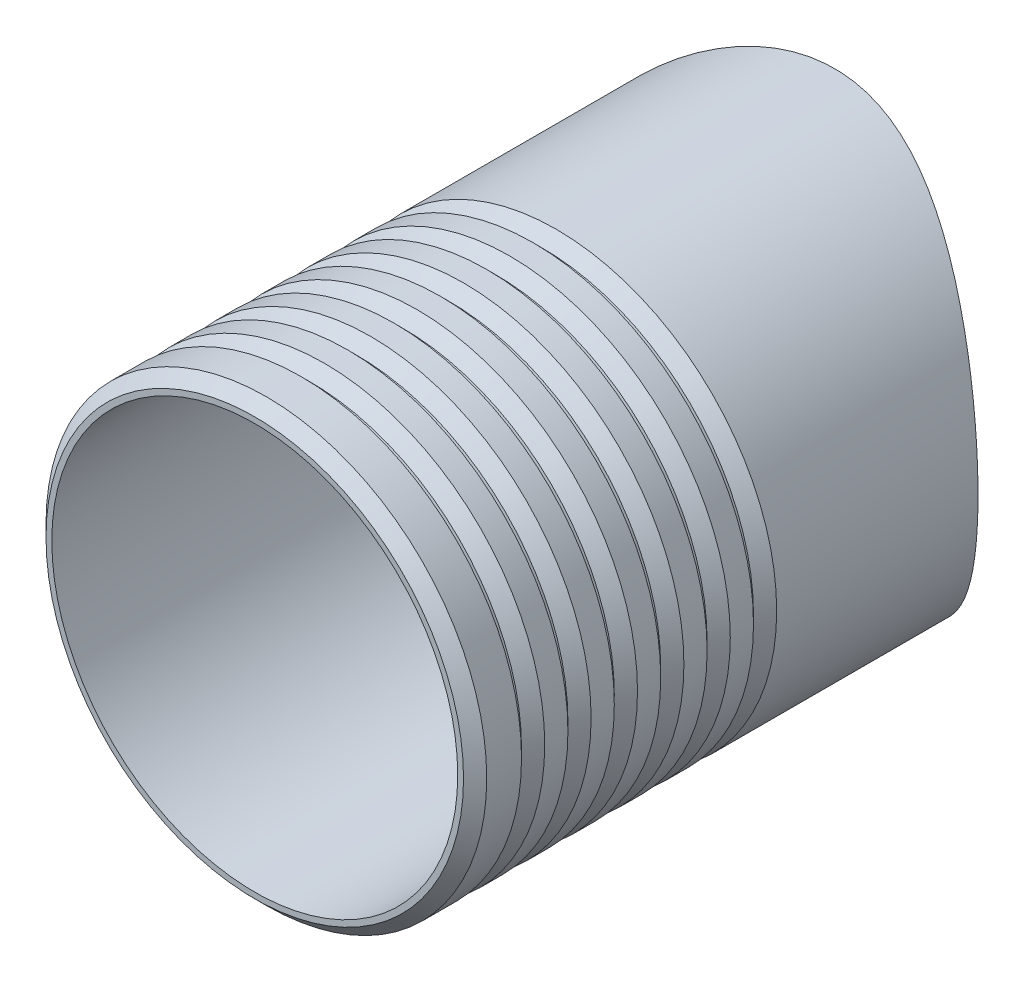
ISO-10303-21;
HEADER;
FILE_DESCRIPTION(('STEP AP214'),'2;1');
FILE_NAME('part.step','',(''),(''),'','','');
FILE_SCHEMA(('AUTOMOTIVE_DESIGN { 1 0 10303 214 1 1 1 1 }'));
ENDSEC;
DATA;
#1=APPLICATION_CONTEXT('core data for automotive mechanical design processes');
#2=APPLICATION_PROTOCOL_DEFINITION('international standard','automotive_design',2000,#1);
#3=PRODUCT_CONTEXT('',#1,'mechanical');
#4=PRODUCT('Part','Part','',(#3));
#5=PRODUCT_RELATED_PRODUCT_CATEGORY('part','',(#4));
#6=PRODUCT_DEFINITION_FORMATION('','',#4);
#7=PRODUCT_DEFINITION_CONTEXT('part definition',#1,'design');
#8=PRODUCT_DEFINITION('design','',#6,#7);
#9=PRODUCT_DEFINITION_SHAPE('','',#8);
#10=(LENGTH_UNIT() NAMED_UNIT(*) SI_UNIT(.MILLI.,.METRE.));
#11=(NAMED_UNIT(*) PLANE_ANGLE_UNIT() SI_UNIT($,.RADIAN.));
#12=(NAMED_UNIT(*) SI_UNIT($,.STERADIAN.) SOLID_ANGLE_UNIT());
#13=UNCERTAINTY_MEASURE_WITH_UNIT(LENGTH_MEASURE(1.E-05),#10,'distance_accuracy_value','');
#14=(GEOMETRIC_REPRESENTATION_CONTEXT(3) GLOBAL_UNCERTAINTY_ASSIGNED_CONTEXT((#13)) GLOBAL_UNIT_ASSIGNED_CONTEXT((#10,
#11,#12)) REPRESENTATION_CONTEXT('',''));
#15=CARTESIAN_POINT('',(0.,0.,0.));
#16=DIRECTION('',(0.,0.,1.));
#17=DIRECTION('',(1.,0.,0.));
#18=AXIS2_PLACEMENT_3D('',#15,#16,#17);
#19=CARTESIAN_POINT('',(0.,0.,100.));
#20=DIRECTION('',(0.,0.,-1.));
#21=DIRECTION('',(-1.,0.,0.));
#22=AXIS2_PLACEMENT_3D('',#19,#20,#21);
#23=CYLINDRICAL_SURFACE('',#22,38.);
#24=CARTESIAN_POINT('',(0.,0.,56.));
#25=DIRECTION('',(0.,0.,1.));
#26=DIRECTION('',(1.,0.,0.));
#27=AXIS2_PLACEMENT_3D('',#24,#25,#26);
#28=CIRCLE('',#27,38.);
#29=CARTESIAN_POINT('',(38.,0.,56.));
#30=VERTEX_POINT('',#29);
#31=EDGE_CURVE('E94',#30,#30,#28,.T.);
#32=ORIENTED_EDGE('',*,*,#31,.F.);
#33=EDGE_LOOP('',(#32));
#34=FACE_BOUND('',#33,.T.);
#35=CARTESIAN_POINT('',(0.,0.,52.));
#36=DIRECTION('',(0.,0.,1.));
#37=DIRECTION('',(1.,0.,0.));
#38=AXIS2_PLACEMENT_3D('',#35,#36,#37);
#39=CIRCLE('',#38,38.);
#40=CARTESIAN_POINT('',(38.,0.,52.));
#41=VERTEX_POINT('',#40);
#42=EDGE_CURVE('E97',#41,#41,#39,.T.);
#43=ORIENTED_EDGE('',*,*,#42,.T.);
#44=EDGE_LOOP('',(#43));
#45=FACE_BOUND('',#44,.T.);
#46=ADVANCED_FACE('F30',(#34,#45),#23,.T.);
#47=CARTESIAN_POINT('',(-38.,0.,13.2820788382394));
#48=CARTESIAN_POINT('',(-37.9999991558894,-0.966377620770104,13.2820774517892));
#49=CARTESIAN_POINT('',(-37.9630888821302,-1.93277648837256,13.2590643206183));
#50=CARTESIAN_POINT('',(-37.8159615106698,-3.85820976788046,13.1675751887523));
#51=CARTESIAN_POINT('',(-37.7057116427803,-4.81724069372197,13.0990788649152));
#52=CARTESIAN_POINT('',(-37.4132111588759,-6.72171246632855,12.9181667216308));
#53=CARTESIAN_POINT('',(-37.2308374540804,-7.66712720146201,12.8056758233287));
#54=CARTESIAN_POINT('',(-36.7965908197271,-9.53577555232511,12.5395239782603));
#55=CARTESIAN_POINT('',(-36.5447248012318,-10.4590113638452,12.3858671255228));
#56=CARTESIAN_POINT('',(-35.9760284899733,-12.2729125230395,12.0417948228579));
#57=CARTESIAN_POINT('',(-35.6595286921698,-13.1637174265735,11.8515666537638));
#58=CARTESIAN_POINT('',(-34.9642393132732,-14.9126675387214,11.4379741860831));
#59=CARTESIAN_POINT('',(-34.5854484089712,-15.7708120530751,11.2146091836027));
#60=CARTESIAN_POINT('',(-33.7692603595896,-17.4501721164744,10.7393530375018));
#61=CARTESIAN_POINT('',(-33.3318787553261,-18.271397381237,10.4874694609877));
#62=CARTESIAN_POINT('',(-32.4019193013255,-19.8739534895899,9.95995796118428));
#63=CARTESIAN_POINT('',(-31.9093391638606,-20.6552826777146,9.68432905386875));
#64=CARTESIAN_POINT('',(-30.8309754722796,-22.235955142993,9.09167511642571));
#65=CARTESIAN_POINT('',(-30.2408945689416,-23.0317858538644,8.77310128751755));
#66=CARTESIAN_POINT('',(-29.0039155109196,-24.5712863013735,8.12069415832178));
#67=CARTESIAN_POINT('',(-28.3570148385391,-25.3149537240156,7.7868601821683));
#68=CARTESIAN_POINT('',(-27.0087665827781,-26.7487596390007,7.11029234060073));
#69=CARTESIAN_POINT('',(-26.3073516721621,-27.4388297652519,6.76754782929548));
#70=CARTESIAN_POINT('',(-24.8535350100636,-28.7622705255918,6.08066373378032));
#71=CARTESIAN_POINT('',(-24.1011303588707,-29.3956379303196,5.73652407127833));
#72=CARTESIAN_POINT('',(-22.4431739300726,-30.6846854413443,5.00843882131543));
#73=CARTESIAN_POINT('',(-21.5306357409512,-31.3319067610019,4.62536564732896));
#74=CARTESIAN_POINT('',(-19.6460920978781,-32.546705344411,3.87878873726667));
#75=CARTESIAN_POINT('',(-18.6740756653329,-33.1142678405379,3.51528863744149));
#76=CARTESIAN_POINT('',(-16.6756085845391,-34.1642564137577,2.82116475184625));
#77=CARTESIAN_POINT('',(-15.6492336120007,-34.6467970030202,2.49049701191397));
#78=CARTESIAN_POINT('',(-13.5457184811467,-35.5219622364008,1.87518984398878));
#79=CARTESIAN_POINT('',(-12.4685993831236,-35.9146237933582,1.59053153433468));
#80=CARTESIAN_POINT('',(-10.5539894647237,-36.5149862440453,1.14675807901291));
#81=CARTESIAN_POINT('',(-9.72633014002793,-36.7442721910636,0.974197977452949));
#82=CARTESIAN_POINT('',(-8.05065201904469,-37.1473978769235,0.667357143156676));
#83=CARTESIAN_POINT('',(-7.20263648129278,-37.3212464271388,0.533070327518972));
#84=CARTESIAN_POINT('',(-5.49212135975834,-37.6110104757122,0.307547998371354));
#85=CARTESIAN_POINT('',(-4.62964036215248,-37.7269951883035,0.216261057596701));
#86=CARTESIAN_POINT('',(-2.89506362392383,-37.8995797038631,0.0799245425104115));
#87=CARTESIAN_POINT('',(-2.02296774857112,-37.9561786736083,0.0348756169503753));
#88=CARTESIAN_POINT('',(-0.273518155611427,-38.009117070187,-0.00724931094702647));
#89=CARTESIAN_POINT('',(0.603843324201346,-38.0053004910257,-0.00420111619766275));
#90=CARTESIAN_POINT('',(2.35469515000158,-37.9370924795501,0.0500478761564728));
#91=CARTESIAN_POINT('',(3.22818547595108,-37.8727007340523,0.101248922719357));
#92=CARTESIAN_POINT('',(4.96530529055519,-37.6843420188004,0.249824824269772));
#93=CARTESIAN_POINT('',(5.82892757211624,-37.5603340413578,0.347231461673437));
#94=CARTESIAN_POINT('',(7.53989452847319,-37.2546016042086,0.584583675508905));
#95=CARTESIAN_POINT('',(8.38723884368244,-37.0728758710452,0.724530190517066));
#96=CARTESIAN_POINT('',(10.0422903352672,-36.658751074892,1.03863585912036));
#97=CARTESIAN_POINT('',(10.8504597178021,-36.4275627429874,1.21196912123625));
#98=CARTESIAN_POINT('',(12.4431047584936,-35.9147475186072,1.58960579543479));
#99=CARTESIAN_POINT('',(13.2275810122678,-35.6331218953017,1.79390842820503));
#100=CARTESIAN_POINT('',(14.7703419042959,-35.0217881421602,2.22819859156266));
#101=CARTESIAN_POINT('',(15.5286218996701,-34.6920715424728,2.45819064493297));
#102=CARTESIAN_POINT('',(17.0169156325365,-33.9868042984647,2.93856103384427));
#103=CARTESIAN_POINT('',(17.7469256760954,-33.6112476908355,3.18894202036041));
#104=CARTESIAN_POINT('',(19.3100147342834,-32.7423979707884,3.75295455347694));
#105=CARTESIAN_POINT('',(20.1370310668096,-32.2401957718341,4.06969240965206));
#106=CARTESIAN_POINT('',(21.7468299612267,-31.1770115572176,4.71662133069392));
#107=CARTESIAN_POINT('',(22.5296085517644,-30.6160242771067,5.04681359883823));
#108=CARTESIAN_POINT('',(24.0495303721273,-29.4371506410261,5.71346539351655));
#109=CARTESIAN_POINT('',(24.7866311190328,-28.8192126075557,6.04993038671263));
#110=CARTESIAN_POINT('',(26.2121899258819,-27.5289927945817,6.72180441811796));
#111=CARTESIAN_POINT('',(26.9006448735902,-26.8567075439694,7.05721338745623));
#112=CARTESIAN_POINT('',(28.3344602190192,-25.3458571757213,7.77438296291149));
#113=CARTESIAN_POINT('',(29.0708045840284,-24.4980504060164,8.15478738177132));
#114=CARTESIAN_POINT('',(30.4695054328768,-22.7348987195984,8.8951405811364));
#115=CARTESIAN_POINT('',(31.1318531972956,-21.8195458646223,9.25508694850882));
#116=CARTESIAN_POINT('',(32.3767695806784,-19.9255716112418,9.94477706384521));
#117=CARTESIAN_POINT('',(32.959357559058,-18.9469656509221,10.2745281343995));
#118=CARTESIAN_POINT('',(34.0385992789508,-16.9316321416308,10.8946303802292));
#119=CARTESIAN_POINT('',(34.5352632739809,-15.8949115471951,11.1849862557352));
#120=CARTESIAN_POINT('',(35.4114475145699,-13.828172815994,11.703057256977));
#121=CARTESIAN_POINT('',(35.7958982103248,-12.8009049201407,11.9333343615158));
#122=CARTESIAN_POINT('',(36.3064341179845,-11.2314742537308,12.2415565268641));
#123=CARTESIAN_POINT('',(36.4656113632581,-10.7034814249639,12.3381119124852));
#124=CARTESIAN_POINT('',(36.7613164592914,-9.63901207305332,12.5181193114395));
#125=CARTESIAN_POINT('',(36.8978473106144,-9.10253668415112,12.6015730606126));
#126=CARTESIAN_POINT('',(37.147559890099,-8.02281507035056,12.7546469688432));
#127=CARTESIAN_POINT('',(37.2607650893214,-7.47957624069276,12.8242810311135));
#128=CARTESIAN_POINT('',(37.463489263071,-6.38713971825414,12.9492582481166));
#129=CARTESIAN_POINT('',(37.5530114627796,-5.83794284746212,13.0046033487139));
#130=CARTESIAN_POINT('',(37.7079669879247,-4.73490552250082,13.1005551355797));
#131=CARTESIAN_POINT('',(37.7734019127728,-4.18106537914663,13.1411628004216));
#132=CARTESIAN_POINT('',(37.8798795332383,-3.07021081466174,13.2073082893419));
#133=CARTESIAN_POINT('',(37.920923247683,-2.51319652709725,13.232846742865));
#134=CARTESIAN_POINT('',(37.9986533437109,-1.00421576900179,13.2812251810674));
#135=CARTESIAN_POINT('',(38.0119050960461,-0.0504257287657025,13.2894925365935));
#136=CARTESIAN_POINT('',(37.9666782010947,1.85455434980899,13.2613247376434));
#137=CARTESIAN_POINT('',(37.9082080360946,2.80574468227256,13.2248948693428));
#138=CARTESIAN_POINT('',(37.7204158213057,4.69833777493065,13.1082602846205));
#139=CARTESIAN_POINT('',(37.591098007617,5.63974111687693,13.0280581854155));
#140=CARTESIAN_POINT('',(37.2633837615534,7.5058497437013,12.8258082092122));
#141=CARTESIAN_POINT('',(37.0649860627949,8.43055472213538,12.703759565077));
#142=CARTESIAN_POINT('',(36.6104690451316,10.2222890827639,12.4260343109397));
#143=CARTESIAN_POINT('',(36.3568261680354,11.090175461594,12.2718097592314));
#144=CARTESIAN_POINT('',(35.7907247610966,12.7997993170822,11.9304233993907));
#145=CARTESIAN_POINT('',(35.4782686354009,13.641537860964,11.7432629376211));
#146=CARTESIAN_POINT('',(34.7975116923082,15.2948527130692,11.3396076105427));
#147=CARTESIAN_POINT('',(34.4292075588,16.1064272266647,11.1231110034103));
#148=CARTESIAN_POINT('',(33.6398288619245,17.6960324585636,10.6647376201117));
#149=CARTESIAN_POINT('',(33.2187509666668,18.4740610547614,10.4228592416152));
#150=CARTESIAN_POINT('',(32.2816491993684,20.0707898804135,9.89232876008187));
#151=CARTESIAN_POINT('',(31.7603288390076,20.8856331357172,9.60142042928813));
#152=CARTESIAN_POINT('',(30.6610587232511,22.4683790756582,8.99970329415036));
#153=CARTESIAN_POINT('',(30.0831058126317,23.2362791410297,8.68889338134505));
#154=CARTESIAN_POINT('',(28.8733143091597,24.7235011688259,8.05306723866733));
#155=CARTESIAN_POINT('',(28.2414222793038,25.4427736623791,7.72803707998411));
#156=CARTESIAN_POINT('',(26.9271670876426,26.829845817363,7.07029521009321));
#157=CARTESIAN_POINT('',(26.2448013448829,27.4976428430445,6.73758310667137));
#158=CARTESIAN_POINT('',(24.7302356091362,28.8722473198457,6.02290663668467));
#159=CARTESIAN_POINT('',(23.8906148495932,29.5708057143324,5.64075487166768));
#160=CARTESIAN_POINT('',(22.1517168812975,30.8949175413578,4.88517096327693));
#161=CARTESIAN_POINT('',(21.2524296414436,31.5204586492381,4.51174030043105));
#162=CARTESIAN_POINT('',(19.397841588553,32.6944574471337,3.78498001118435));
#163=CARTESIAN_POINT('',(18.4425709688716,33.2429561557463,3.43163974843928));
#164=CARTESIAN_POINT('',(16.4790963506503,34.2587264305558,2.75693845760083));
#165=CARTESIAN_POINT('',(15.4709074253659,34.7260209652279,2.43556839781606));
#166=CARTESIAN_POINT('',(13.6235017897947,35.4848792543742,1.90053597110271));
#167=CARTESIAN_POINT('',(12.7933918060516,35.7927282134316,1.67844136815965));
#168=CARTESIAN_POINT('',(11.1060102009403,36.3517004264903,1.26854720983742));
#169=CARTESIAN_POINT('',(10.248741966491,36.602830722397,1.08074339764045));
#170=CARTESIAN_POINT('',(8.51225424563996,37.0451497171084,0.745816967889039));
#171=CARTESIAN_POINT('',(7.63306529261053,37.2364172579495,0.598640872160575));
#172=CARTESIAN_POINT('',(5.8569622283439,37.5567586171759,0.350063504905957));
#173=CARTESIAN_POINT('',(4.96004815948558,37.6858325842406,0.248662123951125));
#174=CARTESIAN_POINT('',(3.14993242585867,37.8802195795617,0.0953042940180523));
#175=CARTESIAN_POINT('',(2.23666749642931,37.9451695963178,0.0436293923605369));
#176=CARTESIAN_POINT('',(0.406353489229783,38.0088588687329,-0.00703820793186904));
#177=CARTESIAN_POINT('',(-0.510695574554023,38.0075983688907,-0.00603110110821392));
#178=CARTESIAN_POINT('',(-2.3410015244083,37.9388816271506,0.0486270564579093));
#179=CARTESIAN_POINT('',(-3.25425708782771,37.8714039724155,0.102295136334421));
#180=CARTESIAN_POINT('',(-5.06916425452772,37.6714359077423,0.259980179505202));
#181=CARTESIAN_POINT('',(-5.97081600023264,37.538946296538,0.363996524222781));
#182=CARTESIAN_POINT('',(-7.68633422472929,37.2239268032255,0.608216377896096));
#183=CARTESIAN_POINT('',(-8.50156837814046,37.0460979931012,0.74497048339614));
#184=CARTESIAN_POINT('',(-10.1123061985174,36.6392036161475,1.0533186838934));
#185=CARTESIAN_POINT('',(-10.9078111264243,36.4101413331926,1.22491054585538));
#186=CARTESIAN_POINT('',(-12.4759639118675,35.9030598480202,1.59809372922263));
#187=CARTESIAN_POINT('',(-13.2486062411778,35.6250289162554,1.79969223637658));
#188=CARTESIAN_POINT('',(-14.7684729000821,35.0222872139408,2.22780905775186));
#189=CARTESIAN_POINT('',(-15.5156937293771,34.6975700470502,2.45433078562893));
#190=CARTESIAN_POINT('',(-16.6693329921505,34.1518596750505,2.82620168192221));
#191=CARTESIAN_POINT('',(-17.0850438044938,33.9457759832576,2.96491374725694));
#192=CARTESIAN_POINT('',(-17.9070690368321,33.5194153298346,3.24789350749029));
#193=CARTESIAN_POINT('',(-18.3133853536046,33.2991412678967,3.39216006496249));
#194=CARTESIAN_POINT('',(-19.5180680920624,32.617427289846,3.83201401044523));
#195=CARTESIAN_POINT('',(-20.3021699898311,32.1350947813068,4.13465622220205));
#196=CARTESIAN_POINT('',(-21.8306110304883,31.1170100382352,4.75194024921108));
#197=CARTESIAN_POINT('',(-22.5749228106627,30.5812217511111,5.06659007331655));
#198=CARTESIAN_POINT('',(-24.021546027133,29.4585075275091,5.70129121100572));
#199=CARTESIAN_POINT('',(-24.7238544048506,28.8715778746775,6.02134291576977));
#200=CARTESIAN_POINT('',(-26.2175964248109,27.5287817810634,6.72330075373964));
#201=CARTESIAN_POINT('',(-26.9996108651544,26.7623210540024,7.10506670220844));
#202=CARTESIAN_POINT('',(-28.4970728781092,25.1618360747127,7.85783148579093));
#203=CARTESIAN_POINT('',(-29.2125118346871,24.3278031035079,8.2288289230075));
#204=CARTESIAN_POINT('',(-30.5727165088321,22.5947551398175,8.95092948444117));
#205=CARTESIAN_POINT('',(-31.2174333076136,21.6956958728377,9.30201875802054));
#206=CARTESIAN_POINT('',(-32.4302733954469,19.8370554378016,9.97495672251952));
#207=CARTESIAN_POINT('',(-32.9984032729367,18.8774794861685,10.2968079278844));
#208=CARTESIAN_POINT('',(-34.0517489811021,16.9034803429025,10.9023484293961));
#209=CARTESIAN_POINT('',(-34.537057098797,15.8891198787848,11.1860801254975));
#210=CARTESIAN_POINT('',(-35.1986248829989,14.3309380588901,11.577203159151));
#211=CARTESIAN_POINT('',(-35.4081282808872,13.8052936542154,11.7018601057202));
#212=CARTESIAN_POINT('',(-35.8042474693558,12.7427296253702,11.9387539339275));
#213=CARTESIAN_POINT('',(-35.9908664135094,12.2058115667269,12.0509925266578));
#214=CARTESIAN_POINT('',(-36.3399662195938,11.123368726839,12.2618576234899));
#215=CARTESIAN_POINT('',(-36.5025166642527,10.5778740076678,12.3605233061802));
#216=CARTESIAN_POINT('',(-36.8034294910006,9.47800438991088,12.5438260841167));
#217=CARTESIAN_POINT('',(-36.9417954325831,8.92363081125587,12.6284652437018));
#218=CARTESIAN_POINT('',(-37.1936696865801,7.80756196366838,12.7829811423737));
#219=CARTESIAN_POINT('',(-37.307191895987,7.24587097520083,12.8528661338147));
#220=CARTESIAN_POINT('',(-37.5089198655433,6.11636764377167,12.9773237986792));
#221=CARTESIAN_POINT('',(-37.5971303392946,5.54855646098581,13.0318993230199));
#222=CARTESIAN_POINT('',(-37.7268722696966,4.56678676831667,13.1122940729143));
#223=CARTESIAN_POINT('',(-37.7745632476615,4.15393905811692,13.1418897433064));
#224=CARTESIAN_POINT('',(-37.8564003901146,3.32652477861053,13.1927186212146));
#225=CARTESIAN_POINT('',(-37.8905505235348,2.9119587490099,13.2139542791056));
#226=CARTESIAN_POINT('',(-37.972568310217,1.66625658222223,13.2649776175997));
#227=CARTESIAN_POINT('',(-38.000000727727,0.833136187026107,13.2820800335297));
#228=CARTESIAN_POINT('',(-38.,0.,13.2820788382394));
#229=B_SPLINE_CURVE_WITH_KNOTS('',3,(#47,#48,#49,#50,#51,#52,#53,#54,#55,#56,#57,#58,#59,#60,
#61,#62,#63,#64,#65,#66,#67,#68,#69,#70,#71,#72,#73,#74,#75,#76,#77,#78,#79,#80,#81,#82,#83,#84,
#85,#86,#87,#88,#89,#90,#91,#92,#93,#94,#95,#96,#97,#98,#99,#100,#101,#102,#103,#104,#105,#106,
#107,#108,#109,#110,#111,#112,#113,#114,#115,#116,#117,#118,#119,#120,#121,#122,#123,#124,#125,
#126,#127,#128,#129,#130,#131,#132,#133,#134,#135,#136,#137,#138,#139,#140,#141,#142,#143,#144,
#145,#146,#147,#148,#149,#150,#151,#152,#153,#154,#155,#156,#157,#158,#159,#160,#161,#162,#163,
#164,#165,#166,#167,#168,#169,#170,#171,#172,#173,#174,#175,#176,#177,#178,#179,#180,#181,#182,
#183,#184,#185,#186,#187,#188,#189,#190,#191,#192,#193,#194,#195,#196,#197,#198,#199,#200,#201,
#202,#203,#204,#205,#206,#207,#208,#209,#210,#211,#212,#213,#214,#215,#216,#217,#218,#219,#220,
#221,#222,#223,#224,#225,#226,#227,#228),.UNSPECIFIED.,.T.,.F.,(4,2,2,2,2,2,2,2,2,2,2,2,2,2,2,2,
2,2,2,2,2,2,2,2,2,2,2,2,2,2,2,2,2,2,2,2,2,2,2,2,2,2,2,2,2,2,2,2,2,2,2,2,2,2,2,2,2,2,2,2,2,2,2,2,
2,2,2,2,2,2,2,2,2,2,2,2,2,2,2,2,2,2,2,2,2,2,2,2,2,2,4),(0.,2.89819975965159,5.79769538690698,
8.70216088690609,11.6063376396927,14.4960203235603,17.3857643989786,20.2747434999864,
23.1638423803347,26.2828010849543,29.401898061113,32.5249104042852,35.6481004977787,
39.1914033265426,42.7353621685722,46.274510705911,49.8122031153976,52.4376384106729,
55.0626562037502,57.6845264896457,60.306433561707,62.9351120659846,65.5638041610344,
68.1943070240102,70.8248679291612,73.397199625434,75.9694666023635,78.5421871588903,
81.1152427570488,84.1665518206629,87.2181343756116,90.2725137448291,93.3270883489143,
96.8795597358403,100.432449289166,103.984474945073,107.536076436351,110.89290997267,
112.571911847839,114.250691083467,115.927772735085,117.60462588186,119.281367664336,
120.958039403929,123.815766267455,126.673155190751,129.530373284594,132.387643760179,
135.136474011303,137.885191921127,140.634073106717,143.383127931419,146.410500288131,
149.43804140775,152.468617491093,155.49934864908,158.96688282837,162.435001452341,
165.901266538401,169.36654959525,172.102359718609,174.837829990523,177.569682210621,
180.301527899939,183.04875162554,185.795965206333,188.544067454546,191.292135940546,
193.826171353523,196.360044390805,198.894525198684,201.42935357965,202.8818936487,
204.334137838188,207.238620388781,210.145075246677,213.051741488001,216.526673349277,
220.002054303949,223.479824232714,226.957294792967,230.430864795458,232.168567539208,
233.906030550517,235.638368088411,237.370450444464,239.101561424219,240.832349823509,
242.081988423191,243.331260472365,245.82986458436),.UNSPECIFIED.);
#230=CARTESIAN_POINT('',(-38.,0.,13.2820788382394));
#231=VERTEX_POINT('',#230);
#232=EDGE_CURVE('E45',#231,#231,#229,.T.);
#233=ORIENTED_EDGE('',*,*,#232,.T.);
#234=EDGE_LOOP('',(#233));
#235=FACE_BOUND('',#234,.T.);
#236=CARTESIAN_POINT('',(0.,0.,48.));
#237=DIRECTION('',(0.,0.,1.));
#238=DIRECTION('',(1.,0.,0.));
#239=AXIS2_PLACEMENT_3D('',#236,#237,#238);
#240=CIRCLE('',#239,38.);
#241=CARTESIAN_POINT('',(38.,0.,48.));
#242=VERTEX_POINT('',#241);
#243=EDGE_CURVE('E100',#242,#242,#240,.T.);
#244=ORIENTED_EDGE('',*,*,#243,.F.);
#245=EDGE_LOOP('',(#244));
#246=FACE_BOUND('',#245,.T.);
#247=ADVANCED_FACE('F84',(#235,#246),#23,.T.);
#248=CARTESIAN_POINT('',(0.,0.,64.));
#249=DIRECTION('',(0.,0.,1.));
#250=DIRECTION('',(1.,0.,0.));
#251=AXIS2_PLACEMENT_3D('',#248,#249,#250);
#252=CIRCLE('',#251,38.);
#253=CARTESIAN_POINT('',(38.,0.,64.));
#254=VERTEX_POINT('',#253);
#255=EDGE_CURVE('E122',#254,#254,#252,.T.);
#256=ORIENTED_EDGE('',*,*,#255,.F.);
#257=EDGE_LOOP('',(#256));
#258=FACE_BOUND('',#257,.T.);
#259=CARTESIAN_POINT('',(0.,0.,60.));
#260=DIRECTION('',(0.,0.,1.));
#261=DIRECTION('',(1.,0.,0.));
#262=AXIS2_PLACEMENT_3D('',#259,#260,#261);
#263=CIRCLE('',#262,38.);
#264=CARTESIAN_POINT('',(38.,0.,60.));
#265=VERTEX_POINT('',#264);
#266=EDGE_CURVE('E113',#265,#265,#263,.T.);
#267=ORIENTED_EDGE('',*,*,#266,.T.);
#268=EDGE_LOOP('',(#267));
#269=FACE_BOUND('',#268,.T.);
#270=ADVANCED_FACE('F89',(#258,#269),#23,.T.);
#271=CARTESIAN_POINT('',(0.,0.,72.));
#272=DIRECTION('',(0.,0.,1.));
#273=DIRECTION('',(1.,0.,0.));
#274=AXIS2_PLACEMENT_3D('',#271,#272,#273);
#275=CIRCLE('',#274,38.);
#276=CARTESIAN_POINT('',(38.,0.,72.));
#277=VERTEX_POINT('',#276);
#278=EDGE_CURVE('E134',#277,#277,#275,.T.);
#279=ORIENTED_EDGE('',*,*,#278,.F.);
#280=EDGE_LOOP('',(#279));
#281=FACE_BOUND('',#280,.T.);
#282=CARTESIAN_POINT('',(0.,0.,68.));
#283=DIRECTION('',(0.,0.,1.));
#284=DIRECTION('',(1.,0.,0.));
#285=AXIS2_PLACEMENT_3D('',#282,#283,#284);
#286=CIRCLE('',#285,38.);
#287=CARTESIAN_POINT('',(38.,0.,68.));
#288=VERTEX_POINT('',#287);
#289=EDGE_CURVE('E125',#288,#288,#286,.T.);
#290=ORIENTED_EDGE('',*,*,#289,.T.);
#291=EDGE_LOOP('',(#290));
#292=FACE_BOUND('',#291,.T.);
#293=ADVANCED_FACE('F327',(#281,#292),#23,.T.);
#294=CARTESIAN_POINT('',(0.,0.,80.));
#295=DIRECTION('',(0.,0.,1.));
#296=DIRECTION('',(1.,0.,0.));
#297=AXIS2_PLACEMENT_3D('',#294,#295,#296);
#298=CIRCLE('',#297,38.);
#299=CARTESIAN_POINT('',(38.,0.,80.));
#300=VERTEX_POINT('',#299);
#301=EDGE_CURVE('E146',#300,#300,#298,.T.);
#302=ORIENTED_EDGE('',*,*,#301,.F.);
#303=EDGE_LOOP('',(#302));
#304=FACE_BOUND('',#303,.T.);
#305=CARTESIAN_POINT('',(0.,0.,76.));
#306=DIRECTION('',(0.,0.,1.));
#307=DIRECTION('',(1.,0.,0.));
#308=AXIS2_PLACEMENT_3D('',#305,#306,#307);
#309=CIRCLE('',#308,38.);
#310=CARTESIAN_POINT('',(38.,0.,76.));
#311=VERTEX_POINT('',#310);
#312=EDGE_CURVE('E137',#311,#311,#309,.T.);
#313=ORIENTED_EDGE('',*,*,#312,.T.);
#314=EDGE_LOOP('',(#313));
#315=FACE_BOUND('',#314,.T.);
#316=ADVANCED_FACE('F317',(#304,#315),#23,.T.);
#317=CARTESIAN_POINT('',(0.,0.,88.));
#318=DIRECTION('',(0.,0.,1.));
#319=DIRECTION('',(1.,0.,0.));
#320=AXIS2_PLACEMENT_3D('',#317,#318,#319);
#321=CIRCLE('',#320,38.);
#322=CARTESIAN_POINT('',(38.,0.,88.));
#323=VERTEX_POINT('',#322);
#324=EDGE_CURVE('E157',#323,#323,#321,.T.);
#325=ORIENTED_EDGE('',*,*,#324,.F.);
#326=EDGE_LOOP('',(#325));
#327=FACE_BOUND('',#326,.T.);
#328=CARTESIAN_POINT('',(0.,0.,84.));
#329=DIRECTION('',(0.,0.,1.));
#330=DIRECTION('',(1.,0.,0.));
#331=AXIS2_PLACEMENT_3D('',#328,#329,#330);
#332=CIRCLE('',#331,38.);
#333=CARTESIAN_POINT('',(38.,0.,84.));
#334=VERTEX_POINT('',#333);
#335=EDGE_CURVE('E149',#334,#334,#332,.T.);
#336=ORIENTED_EDGE('',*,*,#335,.T.);
#337=EDGE_LOOP('',(#336));
#338=FACE_BOUND('',#337,.T.);
#339=ADVANCED_FACE('F76',(#327,#338),#23,.T.);
#340=CARTESIAN_POINT('',(0.,0.,98.));
#341=DIRECTION('',(0.,0.,1.));
#342=DIRECTION('',(1.,0.,0.));
#343=AXIS2_PLACEMENT_3D('',#340,#341,#342);
#344=CIRCLE('',#343,38.);
#345=CARTESIAN_POINT('',(38.,0.,98.));
#346=VERTEX_POINT('',#345);
#347=EDGE_CURVE('E10',#346,#346,#344,.F.);
#348=ORIENTED_EDGE('',*,*,#347,.T.);
#349=EDGE_LOOP('',(#348));
#350=FACE_BOUND('',#349,.T.);
#351=CARTESIAN_POINT('',(0.,0.,92.));
#352=DIRECTION('',(0.,0.,1.));
#353=DIRECTION('',(1.,0.,0.));
#354=AXIS2_PLACEMENT_3D('',#351,#352,#353);
#355=CIRCLE('',#354,38.);
#356=CARTESIAN_POINT('',(38.,0.,92.));
#357=VERTEX_POINT('',#356);
#358=EDGE_CURVE('E54',#357,#357,#355,.T.);
#359=ORIENTED_EDGE('',*,*,#358,.T.);
#360=EDGE_LOOP('',(#359));
#361=FACE_BOUND('',#360,.T.);
#362=ADVANCED_FACE('F72',(#350,#361),#23,.T.);
#363=CARTESIAN_POINT('',(0.,0.,100.));
#364=DIRECTION('',(0.,0.,1.));
#365=DIRECTION('',(1.,0.,0.));
#366=AXIS2_PLACEMENT_3D('',#363,#364,#365);
#367=PLANE('',#366);
#368=CARTESIAN_POINT('',(0.,0.,100.));
#369=DIRECTION('',(0.,0.,1.));
#370=DIRECTION('',(1.,0.,0.));
#371=AXIS2_PLACEMENT_3D('',#368,#369,#370);
#372=CIRCLE('',#371,36.);
#373=CARTESIAN_POINT('',(36.,0.,100.));
#374=VERTEX_POINT('',#373);
#375=EDGE_CURVE('E37',#374,#374,#372,.T.);
#376=ORIENTED_EDGE('',*,*,#375,.T.);
#377=EDGE_LOOP('',(#376));
#378=FACE_BOUND('',#377,.T.);
#379=CARTESIAN_POINT('',(0.,0.,100.));
#380=DIRECTION('',(0.,0.,1.));
#381=DIRECTION('',(1.,0.,0.));
#382=AXIS2_PLACEMENT_3D('',#379,#380,#381);
#383=CIRCLE('',#382,35.);
#384=CARTESIAN_POINT('',(35.,0.,100.));
#385=VERTEX_POINT('',#384);
#386=EDGE_CURVE('E41',#385,#385,#383,.T.);
#387=ORIENTED_EDGE('',*,*,#386,.F.);
#388=EDGE_LOOP('',(#387));
#389=FACE_BOUND('',#388,.T.);
#390=ADVANCED_FACE('F75',(#378,#389),#367,.T.);
#391=CARTESIAN_POINT('',(0.,0.,100.));
#392=DIRECTION('',(0.,0.,-1.));
#393=DIRECTION('',(-1.,0.,0.));
#394=AXIS2_PLACEMENT_3D('',#391,#392,#393);
#395=CYLINDRICAL_SURFACE('',#394,35.);
#396=CARTESIAN_POINT('',(-35.,0.,13.2820788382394));
#397=CARTESIAN_POINT('',(-34.9999921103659,-0.902230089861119,13.2820716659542));
#398=CARTESIAN_POINT('',(-34.9650590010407,-1.80472200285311,13.2620099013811));
#399=CARTESIAN_POINT('',(-34.825749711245,-3.60295957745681,13.1822404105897));
#400=CARTESIAN_POINT('',(-34.721331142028,-4.49870078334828,13.1225084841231));
#401=CARTESIAN_POINT('',(-34.4441138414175,-6.27818298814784,12.9647283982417));
#402=CARTESIAN_POINT('',(-34.2711627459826,-7.16189267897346,12.8665948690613));
#403=CARTESIAN_POINT('',(-33.8591142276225,-8.90874388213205,12.6344663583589));
#404=CARTESIAN_POINT('',(-33.6200262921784,-9.77188832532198,12.5004765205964));
#405=CARTESIAN_POINT('',(-33.0797737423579,-11.4680903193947,12.2005336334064));
#406=CARTESIAN_POINT('',(-32.7789108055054,-12.3012717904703,12.0347361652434));
#407=CARTESIAN_POINT('',(-32.1175061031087,-13.9371556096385,11.6744798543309));
#408=CARTESIAN_POINT('',(-31.7569624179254,-14.739856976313,11.4800200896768));
#409=CARTESIAN_POINT('',(-30.9795954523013,-16.3104941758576,11.0666604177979));
#410=CARTESIAN_POINT('',(-30.5627946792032,-17.0784437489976,10.8477702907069));
#411=CARTESIAN_POINT('',(-29.6759973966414,-18.5766811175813,10.38991510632));
#412=CARTESIAN_POINT('',(-29.2059989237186,-19.3069675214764,10.1509493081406));
#413=CARTESIAN_POINT('',(-28.1798907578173,-20.7787358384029,9.63967822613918));
#414=CARTESIAN_POINT('',(-27.6200070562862,-21.5171835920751,9.36621199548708));
#415=CARTESIAN_POINT('',(-26.4459754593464,-22.9448174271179,8.80749838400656));
#416=CARTESIAN_POINT('',(-25.8318252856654,-23.6340014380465,8.5222505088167));
#417=CARTESIAN_POINT('',(-24.5516474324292,-24.9613242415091,7.94585849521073));
#418=CARTESIAN_POINT('',(-23.8855628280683,-25.5994054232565,7.65470815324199));
#419=CARTESIAN_POINT('',(-22.5049041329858,-26.821244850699,7.07330668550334));
#420=CARTESIAN_POINT('',(-21.7903275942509,-27.4050003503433,6.7830556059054));
#421=CARTESIAN_POINT('',(-20.2341492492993,-28.5767255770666,6.17875454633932));
#422=CARTESIAN_POINT('',(-19.3872191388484,-29.1581032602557,5.86559619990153));
#423=CARTESIAN_POINT('',(-17.640312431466,-30.2469630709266,5.25858256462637));
#424=CARTESIAN_POINT('',(-16.7403282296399,-30.7544345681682,4.9647300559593));
#425=CARTESIAN_POINT('',(-14.8926692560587,-31.6903688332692,4.40709207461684));
#426=CARTESIAN_POINT('',(-13.9450551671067,-32.1189290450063,4.14326967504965));
#427=CARTESIAN_POINT('',(-12.006505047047,-32.8927354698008,3.65597640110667));
#428=CARTESIAN_POINT('',(-11.0155835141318,-33.2380093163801,3.43249214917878));
#429=CARTESIAN_POINT('',(-9.22255020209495,-33.7729815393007,3.08034686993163));
#430=CARTESIAN_POINT('',(-8.42759903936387,-33.9802030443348,2.94165367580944));
#431=CARTESIAN_POINT('',(-6.82001242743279,-34.338976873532,2.69915637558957));
#432=CARTESIAN_POINT('',(-6.00737960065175,-34.4905373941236,2.59534713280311));
#433=CARTESIAN_POINT('',(-4.37022425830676,-34.7359412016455,2.42623765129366));
#434=CARTESIAN_POINT('',(-3.54571346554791,-34.8298378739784,2.36090179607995));
#435=CARTESIAN_POINT('',(-1.88984458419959,-34.9588052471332,2.27095941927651));
#436=CARTESIAN_POINT('',(-1.05848636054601,-34.9938747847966,2.24635370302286));
#437=CARTESIAN_POINT('',(0.605974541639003,-35.0046625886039,2.23879659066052));
#438=CARTESIAN_POINT('',(1.43907803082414,-34.9802974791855,2.2559037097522));
#439=CARTESIAN_POINT('',(3.09954989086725,-34.872410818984,2.33124704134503));
#440=CARTESIAN_POINT('',(3.92691823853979,-34.7888890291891,2.38948342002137));
#441=CARTESIAN_POINT('',(5.57045992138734,-34.5638312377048,2.54498954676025));
#442=CARTESIAN_POINT('',(6.38662638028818,-34.4222611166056,2.64228225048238));
#443=CARTESIAN_POINT('',(8.00203251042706,-34.0829685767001,2.87252428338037));
#444=CARTESIAN_POINT('',(8.80127177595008,-33.8852448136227,3.00547446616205));
#445=CARTESIAN_POINT('',(10.3747227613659,-33.43697475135,3.30207982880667));
#446=CARTESIAN_POINT('',(11.1490338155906,-33.186679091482,3.46558892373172));
#447=CARTESIAN_POINT('',(12.6730066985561,-32.6351287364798,3.8190127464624));
#448=CARTESIAN_POINT('',(13.4226688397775,-32.3338746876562,4.00892713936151));
#449=CARTESIAN_POINT('',(14.8947279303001,-31.6827250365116,4.41029762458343));
#450=CARTESIAN_POINT('',(15.6171187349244,-31.3328185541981,4.62175853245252));
#451=CARTESIAN_POINT('',(17.0323652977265,-30.5865741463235,5.06132611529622));
#452=CARTESIAN_POINT('',(17.725217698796,-30.1902309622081,5.28943467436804));
#453=CARTESIAN_POINT('',(18.7954962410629,-29.5286828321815,5.65936319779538));
#454=CARTESIAN_POINT('',(19.1834247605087,-29.2781310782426,5.7972818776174));
#455=CARTESIAN_POINT('',(19.948234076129,-28.7624863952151,6.07617979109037));
#456=CARTESIAN_POINT('',(20.3251170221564,-28.4973963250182,6.21715841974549));
#457=CARTESIAN_POINT('',(21.4389318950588,-27.6806788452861,6.64343488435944));
#458=CARTESIAN_POINT('',(22.1590327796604,-27.1076023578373,6.93207432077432));
#459=CARTESIAN_POINT('',(23.5519468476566,-25.9066065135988,7.51153392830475));
#460=CARTESIAN_POINT('',(24.2247222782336,-25.2786442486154,7.80235564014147));
#461=CARTESIAN_POINT('',(25.5197357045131,-23.9706085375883,8.37950269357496));
#462=CARTESIAN_POINT('',(26.1419713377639,-23.2905326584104,8.66582782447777));
#463=CARTESIAN_POINT('',(27.4019824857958,-21.7988946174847,9.2603660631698));
#464=CARTESIAN_POINT('',(28.0331830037,-20.9812321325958,9.56726371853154));
#465=CARTESIAN_POINT('',(29.224128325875,-19.2878664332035,10.1593865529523));
#466=CARTESIAN_POINT('',(29.7838665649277,-18.4121578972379,10.4446097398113));
#467=CARTESIAN_POINT('',(30.8263808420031,-16.6078065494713,10.9852918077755));
#468=CARTESIAN_POINT('',(31.30919191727,-15.679188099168,11.2407642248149));
#469=CARTESIAN_POINT('',(32.1925940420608,-13.7745583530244,11.7145959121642));
#470=CARTESIAN_POINT('',(32.5931953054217,-12.7985529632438,11.9329597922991));
#471=CARTESIAN_POINT('',(33.2822395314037,-10.8748997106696,12.3123262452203));
#472=CARTESIAN_POINT('',(33.576496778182,-9.92990961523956,12.4762387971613));
#473=CARTESIAN_POINT('',(34.0849970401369,-8.01228239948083,12.7613531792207));
#474=CARTESIAN_POINT('',(34.2992429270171,-7.03964627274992,12.8825565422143));
#475=CARTESIAN_POINT('',(34.6443125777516,-5.07588735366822,13.0785279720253));
#476=CARTESIAN_POINT('',(34.7752059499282,-4.08478070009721,13.1533347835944));
#477=CARTESIAN_POINT('',(34.9516916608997,-2.09257712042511,13.254330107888));
#478=CARTESIAN_POINT('',(34.997293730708,-1.09148134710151,13.2805241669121));
#479=CARTESIAN_POINT('',(35.0021556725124,0.788091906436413,13.2833173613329));
#480=CARTESIAN_POINT('',(34.9713157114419,1.66655508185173,13.2656031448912));
#481=CARTESIAN_POINT('',(34.8438468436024,3.41705362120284,13.1925942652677));
#482=CARTESIAN_POINT('',(34.7472244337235,4.28908961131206,13.1373033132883));
#483=CARTESIAN_POINT('',(34.4894270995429,6.02042466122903,12.9904752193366));
#484=CARTESIAN_POINT('',(34.3282526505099,6.87972381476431,12.8989383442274));
#485=CARTESIAN_POINT('',(33.9432933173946,8.57977201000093,12.681763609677));
#486=CARTESIAN_POINT('',(33.7195065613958,9.42052049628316,12.5561247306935));
#487=CARTESIAN_POINT('',(33.2147132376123,11.0687526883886,12.2751929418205));
#488=CARTESIAN_POINT('',(32.9343886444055,11.8765064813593,12.1202547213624));
#489=CARTESIAN_POINT('',(32.3177305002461,13.4643882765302,11.7830794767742));
#490=CARTESIAN_POINT('',(31.9813980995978,14.244516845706,11.6008430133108));
#491=CARTESIAN_POINT('',(31.2555631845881,15.7735898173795,11.2126836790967));
#492=CARTESIAN_POINT('',(30.86605395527,16.5225302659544,11.0067578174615));
#493=CARTESIAN_POINT('',(30.036777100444,17.9860942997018,10.5751541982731));
#494=CARTESIAN_POINT('',(29.5970064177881,18.7007157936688,10.3494752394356));
#495=CARTESIAN_POINT('',(28.6216731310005,20.165631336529,9.85815563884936));
#496=CARTESIAN_POINT('',(28.0809040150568,20.9118870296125,9.59080110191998));
#497=CARTESIAN_POINT('',(26.9449332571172,22.3565452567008,9.04282123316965));
#498=CARTESIAN_POINT('',(26.3497283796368,23.0549449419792,8.76219511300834));
#499=CARTESIAN_POINT('',(25.1073575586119,24.4020704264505,8.19338435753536));
#500=CARTESIAN_POINT('',(24.4601369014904,25.0507424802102,7.9051919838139));
#501=CARTESIAN_POINT('',(23.1171025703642,26.2952046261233,7.32781278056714));
#502=CARTESIAN_POINT('',(22.4212866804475,26.8909923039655,7.03862590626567));
#503=CARTESIAN_POINT('',(20.9021852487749,28.091618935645,6.43337185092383));
#504=CARTESIAN_POINT('',(20.0733879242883,28.6898419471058,6.11796936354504));
#505=CARTESIAN_POINT('',(18.3621754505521,29.8140679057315,5.50361464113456));
#506=CARTESIAN_POINT('',(17.4797525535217,30.3400603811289,5.20466479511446));
#507=CARTESIAN_POINT('',(15.6662145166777,31.3149870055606,4.63368312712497));
#508=CARTESIAN_POINT('',(14.7351520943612,31.76400241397,4.36162304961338));
#509=CARTESIAN_POINT('',(12.8284232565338,32.5807667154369,3.85460014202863));
#510=CARTESIAN_POINT('',(11.8527706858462,32.9485406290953,3.61962589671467));
#511=CARTESIAN_POINT('',(10.0761173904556,33.5283261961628,3.24229846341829));
#512=CARTESIAN_POINT('',(9.28239060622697,33.7568286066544,3.09088422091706));
#513=CARTESIAN_POINT('',(7.67533328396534,34.158085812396,2.82200013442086));
#514=CARTESIAN_POINT('',(6.86200549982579,34.3308483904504,2.70452555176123));
#515=CARTESIAN_POINT('',(5.22141331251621,34.6183429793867,2.50757800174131));
#516=CARTESIAN_POINT('',(4.39416349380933,34.7331322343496,2.42806755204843));
#517=CARTESIAN_POINT('',(2.73063398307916,34.9033327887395,2.30975302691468));
#518=CARTESIAN_POINT('',(1.89435415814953,34.9587432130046,2.27094955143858));
#519=CARTESIAN_POINT('',(0.217265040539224,35.0094000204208,2.23548612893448));
#520=CARTESIAN_POINT('',(-0.623550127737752,35.0045166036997,2.23891710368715));
#521=CARTESIAN_POINT('',(-2.30140233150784,34.9343470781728,2.28801037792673));
#522=CARTESIAN_POINT('',(-3.13843935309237,34.8690607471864,2.33367283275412));
#523=CARTESIAN_POINT('',(-4.80291894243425,34.6790149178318,2.4655344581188));
#524=CARTESIAN_POINT('',(-5.63035609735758,34.5542233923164,2.55175545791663));
#525=CARTESIAN_POINT('',(-7.2695558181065,34.2468832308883,2.76163411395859));
#526=CARTESIAN_POINT('',(-8.08131812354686,34.0643336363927,2.88529239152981));
#527=CARTESIAN_POINT('',(-9.66853178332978,33.6478742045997,3.16313470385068));
#528=CARTESIAN_POINT('',(-10.4443835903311,33.4150492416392,3.316668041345));
#529=CARTESIAN_POINT('',(-11.9727378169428,32.8983933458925,3.65123630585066));
#530=CARTESIAN_POINT('',(-12.7252407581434,32.6145635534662,3.8322706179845));
#531=CARTESIAN_POINT('',(-14.2041272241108,31.998199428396,4.21710754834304));
#532=CARTESIAN_POINT('',(-14.9305052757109,31.6656549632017,4.42091490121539));
#533=CARTESIAN_POINT('',(-16.3547844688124,30.954075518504,4.84648701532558));
#534=CARTESIAN_POINT('',(-17.0526822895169,30.5750351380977,5.06825386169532));
#535=CARTESIAN_POINT('',(-18.1292612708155,29.9422581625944,5.42840711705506));
#536=CARTESIAN_POINT('',(-18.5181794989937,29.7032798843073,5.56241467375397));
#537=CARTESIAN_POINT('',(-19.2854352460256,29.2109519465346,5.83391647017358));
#538=CARTESIAN_POINT('',(-19.6637748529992,28.9576051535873,5.97141001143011));
#539=CARTESIAN_POINT('',(-20.7826693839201,28.1763779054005,6.38790007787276));
#540=CARTESIAN_POINT('',(-21.5071026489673,27.627309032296,6.67090693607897));
#541=CARTESIAN_POINT('',(-22.9106961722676,26.4749935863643,7.24104839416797));
#542=CARTESIAN_POINT('',(-23.5898197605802,25.8717040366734,7.52818611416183));
#543=CARTESIAN_POINT('',(-24.899700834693,24.6136046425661,8.10006840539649));
#544=CARTESIAN_POINT('',(-25.5304562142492,23.9587925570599,8.38481287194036));
#545=CARTESIAN_POINT('',(-26.818131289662,22.5131224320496,8.9816935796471));
#546=CARTESIAN_POINT('',(-27.4680966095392,21.7155717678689,9.29268109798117));
#547=CARTESIAN_POINT('',(-28.6984268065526,20.0614751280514,9.8955506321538));
#548=CARTESIAN_POINT('',(-29.278782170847,19.2049211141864,10.1874300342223));
#549=CARTESIAN_POINT('',(-30.3645702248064,17.4375476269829,10.7439458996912));
#550=CARTESIAN_POINT('',(-30.8700290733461,16.5267472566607,11.0085918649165));
#551=CARTESIAN_POINT('',(-31.8007448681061,14.6561662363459,11.5031215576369));
#552=CARTESIAN_POINT('',(-32.2260238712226,13.6963991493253,11.7330148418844));
#553=CARTESIAN_POINT('',(-32.9228322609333,11.9094908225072,12.1138746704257));
#554=CARTESIAN_POINT('',(-33.2082548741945,11.0891820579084,12.2716058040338));
#555=CARTESIAN_POINT('',(-33.7184963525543,9.42447120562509,12.5555554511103));
#556=CARTESIAN_POINT('',(-33.9433133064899,8.58006835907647,12.6817729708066));
#557=CARTESIAN_POINT('',(-34.3292940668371,6.87473952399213,12.8995277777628));
#558=CARTESIAN_POINT('',(-34.4906179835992,6.01386091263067,12.9911522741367));
#559=CARTESIAN_POINT('',(-34.7484057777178,4.27970937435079,13.1379773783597));
#560=CARTESIAN_POINT('',(-34.8449056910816,3.40644360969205,13.1931982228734));
#561=CARTESIAN_POINT('',(-34.9389212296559,2.10949299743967,13.2470501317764));
#562=CARTESIAN_POINT('',(-34.9618153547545,1.68807388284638,13.2601763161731));
#563=CARTESIAN_POINT('',(-34.9923574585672,0.844455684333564,13.2776928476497));
#564=CARTESIAN_POINT('',(-35.000003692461,0.422256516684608,13.2820821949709));
#565=CARTESIAN_POINT('',(-35.,0.,13.2820788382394));
#566=B_SPLINE_CURVE_WITH_KNOTS('',3,(#396,#397,#398,#399,#400,#401,#402,#403,#404,#405,#406,
#407,#408,#409,#410,#411,#412,#413,#414,#415,#416,#417,#418,#419,#420,#421,#422,#423,#424,#425,
#426,#427,#428,#429,#430,#431,#432,#433,#434,#435,#436,#437,#438,#439,#440,#441,#442,#443,#444,
#445,#446,#447,#448,#449,#450,#451,#452,#453,#454,#455,#456,#457,#458,#459,#460,#461,#462,#463,
#464,#465,#466,#467,#468,#469,#470,#471,#472,#473,#474,#475,#476,#477,#478,#479,#480,#481,#482,
#483,#484,#485,#486,#487,#488,#489,#490,#491,#492,#493,#494,#495,#496,#497,#498,#499,#500,#501,
#502,#503,#504,#505,#506,#507,#508,#509,#510,#511,#512,#513,#514,#515,#516,#517,#518,#519,#520,
#521,#522,#523,#524,#525,#526,#527,#528,#529,#530,#531,#532,#533,#534,#535,#536,#537,#538,#539,
#540,#541,#542,#543,#544,#545,#546,#547,#548,#549,#550,#551,#552,#553,#554,#555,#556,#557,#558,
#559,#560,#561,#562,#563,#564,#565),.UNSPECIFIED.,.T.,.F.,(4,2,2,2,2,2,2,2,2,2,2,2,2,2,2,2,2,2,
2,2,2,2,2,2,2,2,2,2,2,2,2,2,2,2,2,2,2,2,2,2,2,2,2,2,2,2,2,2,2,2,2,2,2,2,2,2,2,2,2,2,2,2,2,2,2,2,
2,2,2,2,2,2,2,2,2,2,2,2,2,2,2,2,2,2,4),(0.,2.70625200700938,5.41415644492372,8.12811528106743,
10.8416849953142,13.5423054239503,16.2430127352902,18.942642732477,21.6423724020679,
24.5380394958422,27.4338282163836,30.3328368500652,33.2319919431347,36.4498712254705,
39.6682128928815,42.8825533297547,46.0958258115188,48.5926952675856,51.0891968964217,
53.5833837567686,56.0776199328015,58.5753570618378,61.0731042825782,63.5723217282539,
66.0715990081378,68.5592208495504,71.046811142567,73.534958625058,76.0233881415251,
77.4689464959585,78.9142216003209,81.8047610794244,84.6975808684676,87.5905358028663,
90.8191817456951,94.0481240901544,97.2755915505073,100.502657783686,103.508040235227,
106.513314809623,109.516076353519,112.51849528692,115.152815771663,117.786876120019,
120.420917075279,123.055036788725,125.659102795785,128.263115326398,130.867456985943,
133.471957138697,136.347761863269,139.223737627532,142.102779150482,144.981952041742,
148.187184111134,151.392880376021,154.595171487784,157.796474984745,160.313115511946,
162.829404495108,165.343203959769,167.857040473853,170.376289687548,172.895548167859,
175.416164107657,177.936821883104,180.407726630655,182.878576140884,185.349940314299,
187.821591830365,189.248487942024,190.675100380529,193.52831574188,196.383812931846,
199.239434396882,202.459922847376,205.680850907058,208.900651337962,212.119564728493,
214.765040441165,217.41059956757,220.049443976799,222.686820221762,223.953239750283,
225.219804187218),.UNSPECIFIED.);
#567=CARTESIAN_POINT('',(-35.,0.,13.2820788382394));
#568=VERTEX_POINT('',#567);
#569=EDGE_CURVE('E48',#568,#568,#566,.T.);
#570=ORIENTED_EDGE('',*,*,#569,.F.);
#571=EDGE_LOOP('',(#570));
#572=FACE_BOUND('',#571,.T.);
#573=ORIENTED_EDGE('',*,*,#386,.T.);
#574=EDGE_LOOP('',(#573));
#575=FACE_BOUND('',#574,.T.);
#576=ADVANCED_FACE('F56',(#572,#575),#395,.F.);
#577=CARTESIAN_POINT('',(-38.,0.,-47.7179211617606));
#578=DIRECTION('',(1.,0.,0.));
#579=DIRECTION('',(0.,0.,-1.));
#580=AXIS2_PLACEMENT_3D('',#577,#578,#579);
#581=CYLINDRICAL_SURFACE('',#580,61.);
#582=ORIENTED_EDGE('',*,*,#569,.T.);
#583=EDGE_LOOP('',(#582));
#584=FACE_BOUND('',#583,.T.);
#585=ORIENTED_EDGE('',*,*,#232,.F.);
#586=EDGE_LOOP('',(#585));
#587=FACE_BOUND('',#586,.T.);
#588=ADVANCED_FACE('F59',(#584,#587),#581,.F.);
#589=CARTESIAN_POINT('',(0.,0.,100.));
#590=DIRECTION('',(0.,0.,-1.));
#591=DIRECTION('',(-1.,0.,0.));
#592=AXIS2_PLACEMENT_3D('',#589,#590,#591);
#593=CONICAL_SURFACE('',#592,36.,0.785398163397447);
#594=ORIENTED_EDGE('',*,*,#347,.F.);
#595=EDGE_LOOP('',(#594));
#596=FACE_BOUND('',#595,.T.);
#597=ORIENTED_EDGE('',*,*,#375,.F.);
#598=EDGE_LOOP('',(#597));
#599=FACE_BOUND('',#598,.T.);
#600=ADVANCED_FACE('F32',(#596,#599),#593,.T.);
#601=CARTESIAN_POINT('',(0.,36.5,92.));
#602=DIRECTION('',(0.,0.,-1.));
#603=DIRECTION('',(-1.,0.,0.));
#604=AXIS2_PLACEMENT_3D('',#601,#602,#603);
#605=PLANE('',#604);
#606=CARTESIAN_POINT('',(0.,0.,92.));
#607=DIRECTION('',(0.,0.,1.));
#608=DIRECTION('',(1.,0.,0.));
#609=AXIS2_PLACEMENT_3D('',#606,#607,#608);
#610=CIRCLE('',#609,36.5);
#611=CARTESIAN_POINT('',(36.5,0.,92.));
#612=VERTEX_POINT('',#611);
#613=EDGE_CURVE('E152',#612,#612,#610,.T.);
#614=ORIENTED_EDGE('',*,*,#613,.T.);
#615=EDGE_LOOP('',(#614));
#616=FACE_BOUND('',#615,.T.);
#617=ORIENTED_EDGE('',*,*,#358,.F.);
#618=EDGE_LOOP('',(#617));
#619=FACE_BOUND('',#618,.T.);
#620=ADVANCED_FACE('F64',(#616,#619),#605,.T.);
#621=CARTESIAN_POINT('',(0.,0.,90.5));
#622=DIRECTION('',(0.,0.,-1.));
#623=DIRECTION('',(-1.,0.,0.));
#624=AXIS2_PLACEMENT_3D('',#621,#622,#623);
#625=CONICAL_SURFACE('',#624,36.5,0.540419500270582);
#626=ORIENTED_EDGE('',*,*,#324,.T.);
#627=EDGE_LOOP('',(#626));
#628=FACE_BOUND('',#627,.T.);
#629=CARTESIAN_POINT('',(0.,0.,90.5));
#630=DIRECTION('',(0.,0.,1.));
#631=DIRECTION('',(1.,0.,0.));
#632=AXIS2_PLACEMENT_3D('',#629,#630,#631);
#633=CIRCLE('',#632,36.5);
#634=CARTESIAN_POINT('',(36.5,0.,90.5));
#635=VERTEX_POINT('',#634);
#636=EDGE_CURVE('E155',#635,#635,#633,.T.);
#637=ORIENTED_EDGE('',*,*,#636,.F.);
#638=EDGE_LOOP('',(#637));
#639=FACE_BOUND('',#638,.T.);
#640=ADVANCED_FACE('F166',(#628,#639),#625,.T.);
#641=CARTESIAN_POINT('',(0.,0.,98.));
#642=DIRECTION('',(0.,0.,1.));
#643=DIRECTION('',(1.,0.,0.));
#644=AXIS2_PLACEMENT_3D('',#641,#642,#643);
#645=CYLINDRICAL_SURFACE('',#644,36.5);
#646=ORIENTED_EDGE('',*,*,#636,.T.);
#647=EDGE_LOOP('',(#646));
#648=FACE_BOUND('',#647,.T.);
#649=ORIENTED_EDGE('',*,*,#613,.F.);
#650=EDGE_LOOP('',(#649));
#651=FACE_BOUND('',#650,.T.);
#652=ADVANCED_FACE('F172',(#648,#651),#645,.T.);
#653=CARTESIAN_POINT('',(0.,36.5,84.));
#654=DIRECTION('',(0.,0.,-1.));
#655=DIRECTION('',(-1.,0.,0.));
#656=AXIS2_PLACEMENT_3D('',#653,#654,#655);
#657=PLANE('',#656);
#658=CARTESIAN_POINT('',(0.,0.,84.));
#659=DIRECTION('',(0.,0.,1.));
#660=DIRECTION('',(1.,0.,0.));
#661=AXIS2_PLACEMENT_3D('',#658,#659,#660);
#662=CIRCLE('',#661,36.5);
#663=CARTESIAN_POINT('',(36.5,0.,84.));
#664=VERTEX_POINT('',#663);
#665=EDGE_CURVE('E140',#664,#664,#662,.T.);
#666=ORIENTED_EDGE('',*,*,#665,.T.);
#667=EDGE_LOOP('',(#666));
#668=FACE_BOUND('',#667,.T.);
#669=ORIENTED_EDGE('',*,*,#335,.F.);
#670=EDGE_LOOP('',(#669));
#671=FACE_BOUND('',#670,.T.);
#672=ADVANCED_FACE('F177',(#668,#671),#657,.T.);
#673=CARTESIAN_POINT('',(0.,0.,82.5));
#674=DIRECTION('',(0.,0.,-1.));
#675=DIRECTION('',(-1.,0.,0.));
#676=AXIS2_PLACEMENT_3D('',#673,#674,#675);
#677=CONICAL_SURFACE('',#676,36.5,0.540419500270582);
#678=ORIENTED_EDGE('',*,*,#301,.T.);
#679=EDGE_LOOP('',(#678));
#680=FACE_BOUND('',#679,.T.);
#681=CARTESIAN_POINT('',(0.,0.,82.5));
#682=DIRECTION('',(0.,0.,1.));
#683=DIRECTION('',(1.,0.,0.));
#684=AXIS2_PLACEMENT_3D('',#681,#682,#683);
#685=CIRCLE('',#684,36.5);
#686=CARTESIAN_POINT('',(36.5,0.,82.5));
#687=VERTEX_POINT('',#686);
#688=EDGE_CURVE('E143',#687,#687,#685,.T.);
#689=ORIENTED_EDGE('',*,*,#688,.F.);
#690=EDGE_LOOP('',(#689));
#691=FACE_BOUND('',#690,.T.);
#692=ADVANCED_FACE('F183',(#680,#691),#677,.T.);
#693=CARTESIAN_POINT('',(0.,0.,90.));
#694=DIRECTION('',(0.,0.,1.));
#695=DIRECTION('',(1.,0.,0.));
#696=AXIS2_PLACEMENT_3D('',#693,#694,#695);
#697=CYLINDRICAL_SURFACE('',#696,36.5);
#698=ORIENTED_EDGE('',*,*,#688,.T.);
#699=EDGE_LOOP('',(#698));
#700=FACE_BOUND('',#699,.T.);
#701=ORIENTED_EDGE('',*,*,#665,.F.);
#702=EDGE_LOOP('',(#701));
#703=FACE_BOUND('',#702,.T.);
#704=ADVANCED_FACE('F189',(#700,#703),#697,.T.);
#705=CARTESIAN_POINT('',(0.,36.5,76.));
#706=DIRECTION('',(0.,0.,-1.));
#707=DIRECTION('',(-1.,0.,0.));
#708=AXIS2_PLACEMENT_3D('',#705,#706,#707);
#709=PLANE('',#708);
#710=CARTESIAN_POINT('',(0.,0.,76.));
#711=DIRECTION('',(0.,0.,1.));
#712=DIRECTION('',(1.,0.,0.));
#713=AXIS2_PLACEMENT_3D('',#710,#711,#712);
#714=CIRCLE('',#713,36.5);
#715=CARTESIAN_POINT('',(36.5,0.,76.));
#716=VERTEX_POINT('',#715);
#717=EDGE_CURVE('E128',#716,#716,#714,.T.);
#718=ORIENTED_EDGE('',*,*,#717,.T.);
#719=EDGE_LOOP('',(#718));
#720=FACE_BOUND('',#719,.T.);
#721=ORIENTED_EDGE('',*,*,#312,.F.);
#722=EDGE_LOOP('',(#721));
#723=FACE_BOUND('',#722,.T.);
#724=ADVANCED_FACE('F193',(#720,#723),#709,.T.);
#725=CARTESIAN_POINT('',(0.,0.,74.5));
#726=DIRECTION('',(0.,0.,-1.));
#727=DIRECTION('',(-1.,0.,0.));
#728=AXIS2_PLACEMENT_3D('',#725,#726,#727);
#729=CONICAL_SURFACE('',#728,36.5,0.540419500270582);
#730=ORIENTED_EDGE('',*,*,#278,.T.);
#731=EDGE_LOOP('',(#730));
#732=FACE_BOUND('',#731,.T.);
#733=CARTESIAN_POINT('',(0.,0.,74.5));
#734=DIRECTION('',(0.,0.,1.));
#735=DIRECTION('',(1.,0.,0.));
#736=AXIS2_PLACEMENT_3D('',#733,#734,#735);
#737=CIRCLE('',#736,36.5);
#738=CARTESIAN_POINT('',(36.5,0.,74.5));
#739=VERTEX_POINT('',#738);
#740=EDGE_CURVE('E131',#739,#739,#737,.T.);
#741=ORIENTED_EDGE('',*,*,#740,.F.);
#742=EDGE_LOOP('',(#741));
#743=FACE_BOUND('',#742,.T.);
#744=ADVANCED_FACE('F197',(#732,#743),#729,.T.);
#745=CARTESIAN_POINT('',(0.,0.,82.));
#746=DIRECTION('',(0.,0.,1.));
#747=DIRECTION('',(1.,0.,0.));
#748=AXIS2_PLACEMENT_3D('',#745,#746,#747);
#749=CYLINDRICAL_SURFACE('',#748,36.5);
#750=ORIENTED_EDGE('',*,*,#740,.T.);
#751=EDGE_LOOP('',(#750));
#752=FACE_BOUND('',#751,.T.);
#753=ORIENTED_EDGE('',*,*,#717,.F.);
#754=EDGE_LOOP('',(#753));
#755=FACE_BOUND('',#754,.T.);
#756=ADVANCED_FACE('F201',(#752,#755),#749,.T.);
#757=CARTESIAN_POINT('',(0.,36.5,68.));
#758=DIRECTION('',(0.,0.,-1.));
#759=DIRECTION('',(-1.,0.,0.));
#760=AXIS2_PLACEMENT_3D('',#757,#758,#759);
#761=PLANE('',#760);
#762=CARTESIAN_POINT('',(0.,0.,68.));
#763=DIRECTION('',(0.,0.,1.));
#764=DIRECTION('',(1.,0.,0.));
#765=AXIS2_PLACEMENT_3D('',#762,#763,#764);
#766=CIRCLE('',#765,36.5);
#767=CARTESIAN_POINT('',(36.5,0.,68.));
#768=VERTEX_POINT('',#767);
#769=EDGE_CURVE('E116',#768,#768,#766,.T.);
#770=ORIENTED_EDGE('',*,*,#769,.T.);
#771=EDGE_LOOP('',(#770));
#772=FACE_BOUND('',#771,.T.);
#773=ORIENTED_EDGE('',*,*,#289,.F.);
#774=EDGE_LOOP('',(#773));
#775=FACE_BOUND('',#774,.T.);
#776=ADVANCED_FACE('F205',(#772,#775),#761,.T.);
#777=CARTESIAN_POINT('',(0.,0.,66.5));
#778=DIRECTION('',(0.,0.,-1.));
#779=DIRECTION('',(-1.,0.,0.));
#780=AXIS2_PLACEMENT_3D('',#777,#778,#779);
#781=CONICAL_SURFACE('',#780,36.5,0.540419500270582);
#782=ORIENTED_EDGE('',*,*,#255,.T.);
#783=EDGE_LOOP('',(#782));
#784=FACE_BOUND('',#783,.T.);
#785=CARTESIAN_POINT('',(0.,0.,66.5));
#786=DIRECTION('',(0.,0.,1.));
#787=DIRECTION('',(1.,0.,0.));
#788=AXIS2_PLACEMENT_3D('',#785,#786,#787);
#789=CIRCLE('',#788,36.5);
#790=CARTESIAN_POINT('',(36.5,0.,66.5));
#791=VERTEX_POINT('',#790);
#792=EDGE_CURVE('E119',#791,#791,#789,.T.);
#793=ORIENTED_EDGE('',*,*,#792,.F.);
#794=EDGE_LOOP('',(#793));
#795=FACE_BOUND('',#794,.T.);
#796=ADVANCED_FACE('F209',(#784,#795),#781,.T.);
#797=CARTESIAN_POINT('',(0.,0.,74.));
#798=DIRECTION('',(0.,0.,1.));
#799=DIRECTION('',(1.,0.,0.));
#800=AXIS2_PLACEMENT_3D('',#797,#798,#799);
#801=CYLINDRICAL_SURFACE('',#800,36.5);
#802=ORIENTED_EDGE('',*,*,#792,.T.);
#803=EDGE_LOOP('',(#802));
#804=FACE_BOUND('',#803,.T.);
#805=ORIENTED_EDGE('',*,*,#769,.F.);
#806=EDGE_LOOP('',(#805));
#807=FACE_BOUND('',#806,.T.);
#808=ADVANCED_FACE('F213',(#804,#807),#801,.T.);
#809=CARTESIAN_POINT('',(0.,36.5,60.));
#810=DIRECTION('',(0.,0.,-1.));
#811=DIRECTION('',(-1.,0.,0.));
#812=AXIS2_PLACEMENT_3D('',#809,#810,#811);
#813=PLANE('',#812);
#814=CARTESIAN_POINT('',(0.,0.,60.));
#815=DIRECTION('',(0.,0.,1.));
#816=DIRECTION('',(1.,0.,0.));
#817=AXIS2_PLACEMENT_3D('',#814,#815,#816);
#818=CIRCLE('',#817,36.5);
#819=CARTESIAN_POINT('',(36.5,0.,60.));
#820=VERTEX_POINT('',#819);
#821=EDGE_CURVE('E99',#820,#820,#818,.T.);
#822=ORIENTED_EDGE('',*,*,#821,.T.);
#823=EDGE_LOOP('',(#822));
#824=FACE_BOUND('',#823,.T.);
#825=ORIENTED_EDGE('',*,*,#266,.F.);
#826=EDGE_LOOP('',(#825));
#827=FACE_BOUND('',#826,.T.);
#828=ADVANCED_FACE('F217',(#824,#827),#813,.T.);
#829=CARTESIAN_POINT('',(0.,0.,58.5));
#830=DIRECTION('',(0.,0.,-1.));
#831=DIRECTION('',(-1.,0.,0.));
#832=AXIS2_PLACEMENT_3D('',#829,#830,#831);
#833=CONICAL_SURFACE('',#832,36.5,0.540419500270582);
#834=ORIENTED_EDGE('',*,*,#31,.T.);
#835=EDGE_LOOP('',(#834));
#836=FACE_BOUND('',#835,.T.);
#837=CARTESIAN_POINT('',(0.,0.,58.5));
#838=DIRECTION('',(0.,0.,1.));
#839=DIRECTION('',(1.,0.,0.));
#840=AXIS2_PLACEMENT_3D('',#837,#838,#839);
#841=CIRCLE('',#840,36.5);
#842=CARTESIAN_POINT('',(36.5,0.,58.5));
#843=VERTEX_POINT('',#842);
#844=EDGE_CURVE('E103',#843,#843,#841,.T.);
#845=ORIENTED_EDGE('',*,*,#844,.F.);
#846=EDGE_LOOP('',(#845));
#847=FACE_BOUND('',#846,.T.);
#848=ADVANCED_FACE('F221',(#836,#847),#833,.T.);
#849=CARTESIAN_POINT('',(0.,0.,66.));
#850=DIRECTION('',(0.,0.,1.));
#851=DIRECTION('',(1.,0.,0.));
#852=AXIS2_PLACEMENT_3D('',#849,#850,#851);
#853=CYLINDRICAL_SURFACE('',#852,36.5);
#854=ORIENTED_EDGE('',*,*,#844,.T.);
#855=EDGE_LOOP('',(#854));
#856=FACE_BOUND('',#855,.T.);
#857=ORIENTED_EDGE('',*,*,#821,.F.);
#858=EDGE_LOOP('',(#857));
#859=FACE_BOUND('',#858,.T.);
#860=ADVANCED_FACE('F225',(#856,#859),#853,.T.);
#861=CARTESIAN_POINT('',(0.,36.5,52.));
#862=DIRECTION('',(0.,0.,-1.));
#863=DIRECTION('',(-1.,0.,0.));
#864=AXIS2_PLACEMENT_3D('',#861,#862,#863);
#865=PLANE('',#864);
#866=CARTESIAN_POINT('',(0.,0.,52.));
#867=DIRECTION('',(0.,0.,1.));
#868=DIRECTION('',(1.,0.,0.));
#869=AXIS2_PLACEMENT_3D('',#866,#867,#868);
#870=CIRCLE('',#869,36.5);
#871=CARTESIAN_POINT('',(36.5,0.,52.));
#872=VERTEX_POINT('',#871);
#873=EDGE_CURVE('E248',#872,#872,#870,.T.);
#874=ORIENTED_EDGE('',*,*,#873,.T.);
#875=EDGE_LOOP('',(#874));
#876=FACE_BOUND('',#875,.T.);
#877=ORIENTED_EDGE('',*,*,#42,.F.);
#878=EDGE_LOOP('',(#877));
#879=FACE_BOUND('',#878,.T.);
#880=ADVANCED_FACE('F229',(#876,#879),#865,.T.);
#881=CARTESIAN_POINT('',(0.,0.,50.5));
#882=DIRECTION('',(0.,0.,-1.));
#883=DIRECTION('',(-1.,0.,0.));
#884=AXIS2_PLACEMENT_3D('',#881,#882,#883);
#885=CONICAL_SURFACE('',#884,36.5,0.540419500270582);
#886=ORIENTED_EDGE('',*,*,#243,.T.);
#887=EDGE_LOOP('',(#886));
#888=FACE_BOUND('',#887,.T.);
#889=CARTESIAN_POINT('',(0.,0.,50.5));
#890=DIRECTION('',(0.,0.,1.));
#891=DIRECTION('',(1.,0.,0.));
#892=AXIS2_PLACEMENT_3D('',#889,#890,#891);
#893=CIRCLE('',#892,36.5);
#894=CARTESIAN_POINT('',(36.5,0.,50.5));
#895=VERTEX_POINT('',#894);
#896=EDGE_CURVE('E106',#895,#895,#893,.T.);
#897=ORIENTED_EDGE('',*,*,#896,.F.);
#898=EDGE_LOOP('',(#897));
#899=FACE_BOUND('',#898,.T.);
#900=ADVANCED_FACE('F233',(#888,#899),#885,.T.);
#901=CARTESIAN_POINT('',(0.,0.,58.));
#902=DIRECTION('',(0.,0.,1.));
#903=DIRECTION('',(1.,0.,0.));
#904=AXIS2_PLACEMENT_3D('',#901,#902,#903);
#905=CYLINDRICAL_SURFACE('',#904,36.5);
#906=ORIENTED_EDGE('',*,*,#896,.T.);
#907=EDGE_LOOP('',(#906));
#908=FACE_BOUND('',#907,.T.);
#909=ORIENTED_EDGE('',*,*,#873,.F.);
#910=EDGE_LOOP('',(#909));
#911=FACE_BOUND('',#910,.T.);
#912=ADVANCED_FACE('F237',(#908,#911),#905,.T.);
#913=CLOSED_SHELL('',(#46,#247,#270,#293,#316,#339,#362,#390,#576,#588,#600,#620,#640,#652,#672,
#692,#704,#724,#744,#756,#776,#796,#808,#828,#848,#860,#880,#900,#912));
#914=MANIFOLD_SOLID_BREP('B2',#913);
#915=ADVANCED_BREP_SHAPE_REPRESENTATION('',(#18,#914),#14);
#916=SHAPE_DEFINITION_REPRESENTATION(#9,#915);
ENDSEC;
END-ISO-10303-21;
